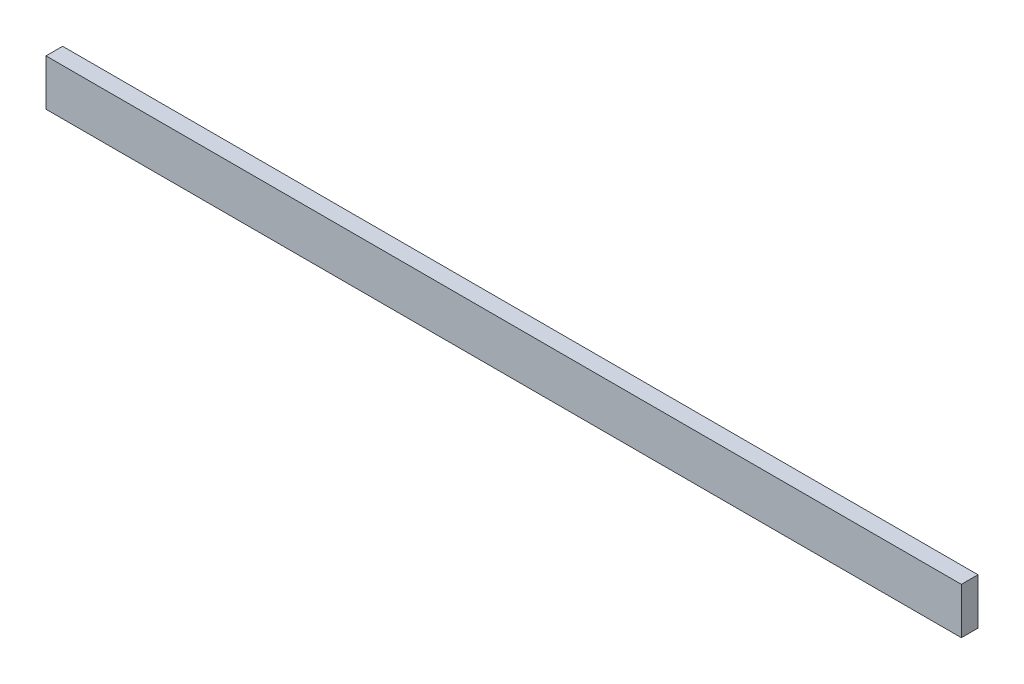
ISO-10303-21;
HEADER;
FILE_DESCRIPTION(('STEP AP214'),'2;1');
FILE_NAME('part.step','',(''),(''),'','','');
FILE_SCHEMA(('AUTOMOTIVE_DESIGN { 1 0 10303 214 1 1 1 1 }'));
ENDSEC;
DATA;
#1=APPLICATION_CONTEXT('core data for automotive mechanical design processes');
#2=APPLICATION_PROTOCOL_DEFINITION('international standard','automotive_design',2000,#1);
#3=PRODUCT_CONTEXT('',#1,'mechanical');
#4=PRODUCT('Part','Part','',(#3));
#5=PRODUCT_RELATED_PRODUCT_CATEGORY('part','',(#4));
#6=PRODUCT_DEFINITION_FORMATION('','',#4);
#7=PRODUCT_DEFINITION_CONTEXT('part definition',#1,'design');
#8=PRODUCT_DEFINITION('design','',#6,#7);
#9=PRODUCT_DEFINITION_SHAPE('','',#8);
#10=(LENGTH_UNIT() NAMED_UNIT(*) SI_UNIT(.MILLI.,.METRE.));
#11=(NAMED_UNIT(*) PLANE_ANGLE_UNIT() SI_UNIT($,.RADIAN.));
#12=(NAMED_UNIT(*) SI_UNIT($,.STERADIAN.) SOLID_ANGLE_UNIT());
#13=UNCERTAINTY_MEASURE_WITH_UNIT(LENGTH_MEASURE(1.E-05),#10,'distance_accuracy_value','');
#14=(GEOMETRIC_REPRESENTATION_CONTEXT(3) GLOBAL_UNCERTAINTY_ASSIGNED_CONTEXT((#13)) GLOBAL_UNIT_ASSIGNED_CONTEXT((#10,
#11,#12)) REPRESENTATION_CONTEXT('',''));
#15=CARTESIAN_POINT('',(0.,0.,0.));
#16=DIRECTION('',(0.,0.,1.));
#17=DIRECTION('',(1.,0.,0.));
#18=AXIS2_PLACEMENT_3D('',#15,#16,#17);
#19=CARTESIAN_POINT('',(-1018.,632.000000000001,-18.));
#20=DIRECTION('',(-1.,0.,0.));
#21=DIRECTION('',(0.,0.,1.));
#22=AXIS2_PLACEMENT_3D('',#19,#20,#21);
#23=PLANE('',#22);
#24=DIRECTION('',(0.,-1.,0.));
#25=VECTOR('',#24,1.);
#26=CARTESIAN_POINT('',(-1018.,632.000000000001,0.));
#27=LINE('',#26,#25);
#28=CARTESIAN_POINT('',(-1018.,632.000000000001,0.));
#29=VERTEX_POINT('',#28);
#30=CARTESIAN_POINT('',(-1018.,581.999999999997,0.));
#31=VERTEX_POINT('',#30);
#32=EDGE_CURVE('E97',#29,#31,#27,.T.);
#33=ORIENTED_EDGE('',*,*,#32,.F.);
#34=DIRECTION('',(0.,0.,1.));
#35=VECTOR('',#34,1.);
#36=CARTESIAN_POINT('',(-1018.,632.000000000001,-18.));
#37=LINE('',#36,#35);
#38=CARTESIAN_POINT('',(-1018.,632.000000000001,-18.));
#39=VERTEX_POINT('',#38);
#40=EDGE_CURVE('E11',#39,#29,#37,.T.);
#41=ORIENTED_EDGE('',*,*,#40,.F.);
#42=DIRECTION('',(0.,-1.,0.));
#43=VECTOR('',#42,1.);
#44=CARTESIAN_POINT('',(-1018.,632.000000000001,-18.));
#45=LINE('',#44,#43);
#46=CARTESIAN_POINT('',(-1018.,581.999999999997,-18.));
#47=VERTEX_POINT('',#46);
#48=EDGE_CURVE('E91',#39,#47,#45,.T.);
#49=ORIENTED_EDGE('',*,*,#48,.T.);
#50=DIRECTION('',(0.,0.,1.));
#51=VECTOR('',#50,1.);
#52=CARTESIAN_POINT('',(-1018.,581.999999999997,-18.));
#53=LINE('',#52,#51);
#54=EDGE_CURVE('E36',#47,#31,#53,.T.);
#55=ORIENTED_EDGE('',*,*,#54,.T.);
#56=EDGE_LOOP('',(#33,#41,#49,#55));
#57=FACE_BOUND('',#56,.T.);
#58=ADVANCED_FACE('F33',(#57),#23,.T.);
#59=CARTESIAN_POINT('',(-1018.,632.000000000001,-18.));
#60=DIRECTION('',(0.,1.,0.));
#61=DIRECTION('',(0.,0.,1.));
#62=AXIS2_PLACEMENT_3D('',#59,#60,#61);
#63=PLANE('',#62);
#64=DIRECTION('',(-1.,0.,0.));
#65=VECTOR('',#64,1.);
#66=CARTESIAN_POINT('',(-1018.,632.000000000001,0.));
#67=LINE('',#66,#65);
#68=CARTESIAN_POINT('',(-28.,632.000000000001,0.));
#69=VERTEX_POINT('',#68);
#70=EDGE_CURVE('E93',#69,#29,#67,.T.);
#71=ORIENTED_EDGE('',*,*,#70,.F.);
#72=DIRECTION('',(0.,0.,1.));
#73=VECTOR('',#72,1.);
#74=CARTESIAN_POINT('',(-28.,632.000000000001,-18.));
#75=LINE('',#74,#73);
#76=CARTESIAN_POINT('',(-28.,632.000000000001,-18.));
#77=VERTEX_POINT('',#76);
#78=EDGE_CURVE('E42',#77,#69,#75,.T.);
#79=ORIENTED_EDGE('',*,*,#78,.F.);
#80=DIRECTION('',(-1.,0.,0.));
#81=VECTOR('',#80,1.);
#82=CARTESIAN_POINT('',(-1018.,632.000000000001,-18.));
#83=LINE('',#82,#81);
#84=EDGE_CURVE('E88',#77,#39,#83,.T.);
#85=ORIENTED_EDGE('',*,*,#84,.T.);
#86=ORIENTED_EDGE('',*,*,#40,.T.);
#87=EDGE_LOOP('',(#71,#79,#85,#86));
#88=FACE_BOUND('',#87,.T.);
#89=ADVANCED_FACE('F107',(#88),#63,.T.);
#90=CARTESIAN_POINT('',(-28.,632.000000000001,-18.));
#91=DIRECTION('',(1.,0.,0.));
#92=DIRECTION('',(0.,0.,-1.));
#93=AXIS2_PLACEMENT_3D('',#90,#91,#92);
#94=PLANE('',#93);
#95=DIRECTION('',(0.,1.,0.));
#96=VECTOR('',#95,1.);
#97=CARTESIAN_POINT('',(-28.,632.000000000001,0.));
#98=LINE('',#97,#96);
#99=CARTESIAN_POINT('',(-28.,581.999999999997,0.));
#100=VERTEX_POINT('',#99);
#101=EDGE_CURVE('E83',#100,#69,#98,.T.);
#102=ORIENTED_EDGE('',*,*,#101,.F.);
#103=DIRECTION('',(0.,0.,1.));
#104=VECTOR('',#103,1.);
#105=CARTESIAN_POINT('',(-28.,581.999999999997,-18.));
#106=LINE('',#105,#104);
#107=CARTESIAN_POINT('',(-28.,581.999999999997,-18.));
#108=VERTEX_POINT('',#107);
#109=EDGE_CURVE('E78',#108,#100,#106,.T.);
#110=ORIENTED_EDGE('',*,*,#109,.F.);
#111=DIRECTION('',(0.,1.,0.));
#112=VECTOR('',#111,1.);
#113=CARTESIAN_POINT('',(-28.,632.000000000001,-18.));
#114=LINE('',#113,#112);
#115=EDGE_CURVE('E81',#108,#77,#114,.T.);
#116=ORIENTED_EDGE('',*,*,#115,.T.);
#117=ORIENTED_EDGE('',*,*,#78,.T.);
#118=EDGE_LOOP('',(#102,#110,#116,#117));
#119=FACE_BOUND('',#118,.T.);
#120=ADVANCED_FACE('F80',(#119),#94,.T.);
#121=CARTESIAN_POINT('',(-1018.,581.999999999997,-18.));
#122=DIRECTION('',(0.,-1.,0.));
#123=DIRECTION('',(0.,0.,-1.));
#124=AXIS2_PLACEMENT_3D('',#121,#122,#123);
#125=PLANE('',#124);
#126=DIRECTION('',(1.,0.,0.));
#127=VECTOR('',#126,1.);
#128=CARTESIAN_POINT('',(-1018.,581.999999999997,0.));
#129=LINE('',#128,#127);
#130=EDGE_CURVE('E100',#31,#100,#129,.T.);
#131=ORIENTED_EDGE('',*,*,#130,.F.);
#132=ORIENTED_EDGE('',*,*,#54,.F.);
#133=DIRECTION('',(1.,0.,0.));
#134=VECTOR('',#133,1.);
#135=CARTESIAN_POINT('',(-1018.,581.999999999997,-18.));
#136=LINE('',#135,#134);
#137=EDGE_CURVE('E87',#47,#108,#136,.T.);
#138=ORIENTED_EDGE('',*,*,#137,.T.);
#139=ORIENTED_EDGE('',*,*,#109,.T.);
#140=EDGE_LOOP('',(#131,#132,#138,#139));
#141=FACE_BOUND('',#140,.T.);
#142=ADVANCED_FACE('F90',(#141),#125,.T.);
#143=CARTESIAN_POINT('',(0.,0.,-18.));
#144=DIRECTION('',(0.,0.,1.));
#145=DIRECTION('',(1.,0.,0.));
#146=AXIS2_PLACEMENT_3D('',#143,#144,#145);
#147=PLANE('',#146);
#148=ORIENTED_EDGE('',*,*,#48,.F.);
#149=ORIENTED_EDGE('',*,*,#84,.F.);
#150=ORIENTED_EDGE('',*,*,#115,.F.);
#151=ORIENTED_EDGE('',*,*,#137,.F.);
#152=EDGE_LOOP('',(#148,#149,#150,#151));
#153=FACE_BOUND('',#152,.T.);
#154=ADVANCED_FACE('F86',(#153),#147,.F.);
#155=CARTESIAN_POINT('',(0.,0.,0.));
#156=DIRECTION('',(0.,0.,1.));
#157=DIRECTION('',(1.,0.,0.));
#158=AXIS2_PLACEMENT_3D('',#155,#156,#157);
#159=PLANE('',#158);
#160=ORIENTED_EDGE('',*,*,#32,.T.);
#161=ORIENTED_EDGE('',*,*,#130,.T.);
#162=ORIENTED_EDGE('',*,*,#101,.T.);
#163=ORIENTED_EDGE('',*,*,#70,.T.);
#164=EDGE_LOOP('',(#160,#161,#162,#163));
#165=FACE_BOUND('',#164,.T.);
#166=ADVANCED_FACE('F106',(#165),#159,.T.);
#167=CLOSED_SHELL('',(#58,#89,#120,#142,#154,#166));
#168=MANIFOLD_SOLID_BREP('B2',#167);
#169=ADVANCED_BREP_SHAPE_REPRESENTATION('',(#18,#168),#14);
#170=SHAPE_DEFINITION_REPRESENTATION(#9,#169);
ENDSEC;
END-ISO-10303-21;
